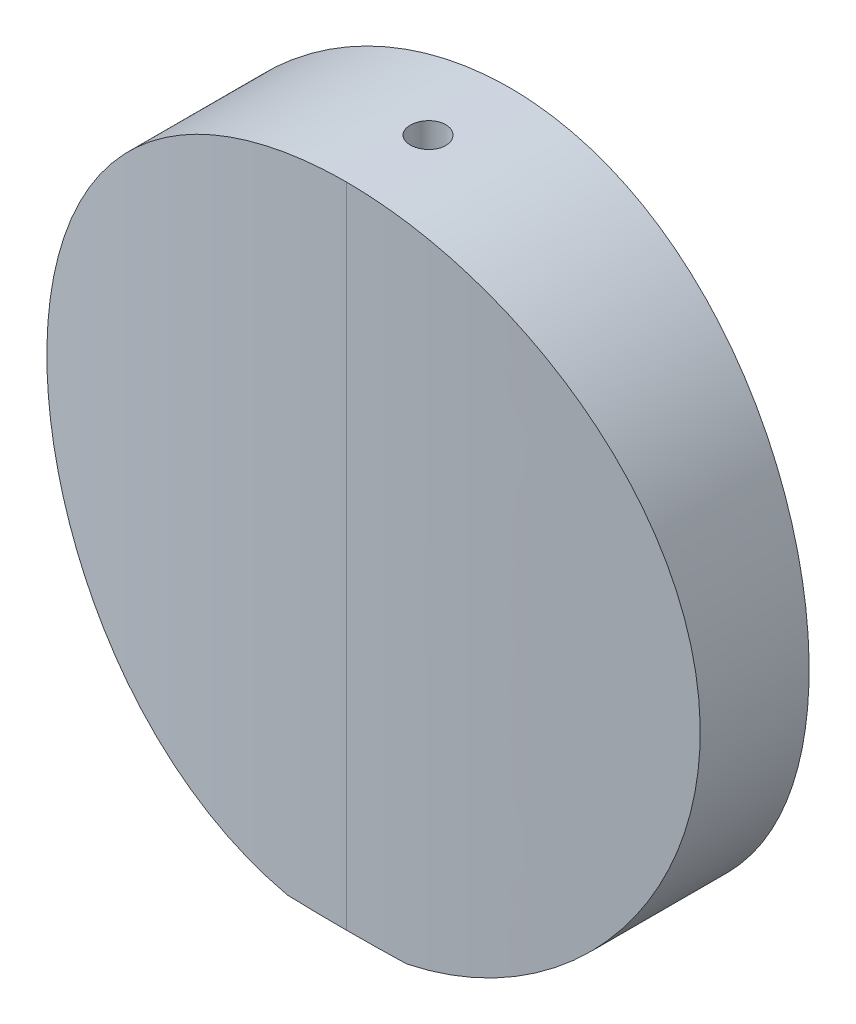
from build123d import *

# Parameters (mm, degrees)
SKETCH_1_R          = 3.25
EXTRUDE_2_DEPTH     = 120
SKETCH_5_OUTSIDE_W  = 156.468
SKETCH_5_OUTSIDE_H  = 156.468
SKETCH_5_OUTSIDE_R  = 60
CUT_EXTRUDE_2_DEPTH = 60


with BuildPart() as part:
    # Sketch 1 → Extrude 2 (new body)
    with BuildSketch(Plane(origin=(0, 0, 0), x_dir=(1, 0, 0), z_dir=(0, 1, 0))):
        with BuildLine():
            Line((60, 10), (60, -10))
            add(Edge.make_bspline(
                [(60, -10), (30.855228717, -15), (0, -15)],
                knots=[0, 0, 0, 1, 1, 1], degree=2))
            add(Edge.make_bspline(
                [(-60, -10), (-30.855228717, -15), (0, -15)],
                knots=[0, 0, 0, 1, 1, 1], degree=2))
            Line((-60, -10), (-60, 10))
            add(Edge.make_bspline(
                [(-60, 10), (-30.855228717, 15), (0, 15)],
                knots=[0, 0, 0, 1, 1, 1], degree=2))
            add(Edge.make_bspline(
                [(60, 10), (30.855228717, 15), (0, 15)],
                knots=[0, 0, 0, 1, 1, 1], degree=2))
        make_face()
        with Locations(Location((0, 0, 0), (0, 0, 270))):
            Circle(SKETCH_1_R, mode=Mode.SUBTRACT)
    extrude(amount=EXTRUDE_2_DEPTH)

    # Sketch 5 outside → Cut-Extrude 2 (cut, symmetric)
    with BuildSketch(Plane.XY):
        with Locations((0, 60)):
            Rectangle(SKETCH_5_OUTSIDE_W, SKETCH_5_OUTSIDE_H)
        with Locations((0, 59)):
            Circle(SKETCH_5_OUTSIDE_R, mode=Mode.SUBTRACT)
    extrude(amount=CUT_EXTRUDE_2_DEPTH, both=True, mode=Mode.SUBTRACT)


solid = part.part
